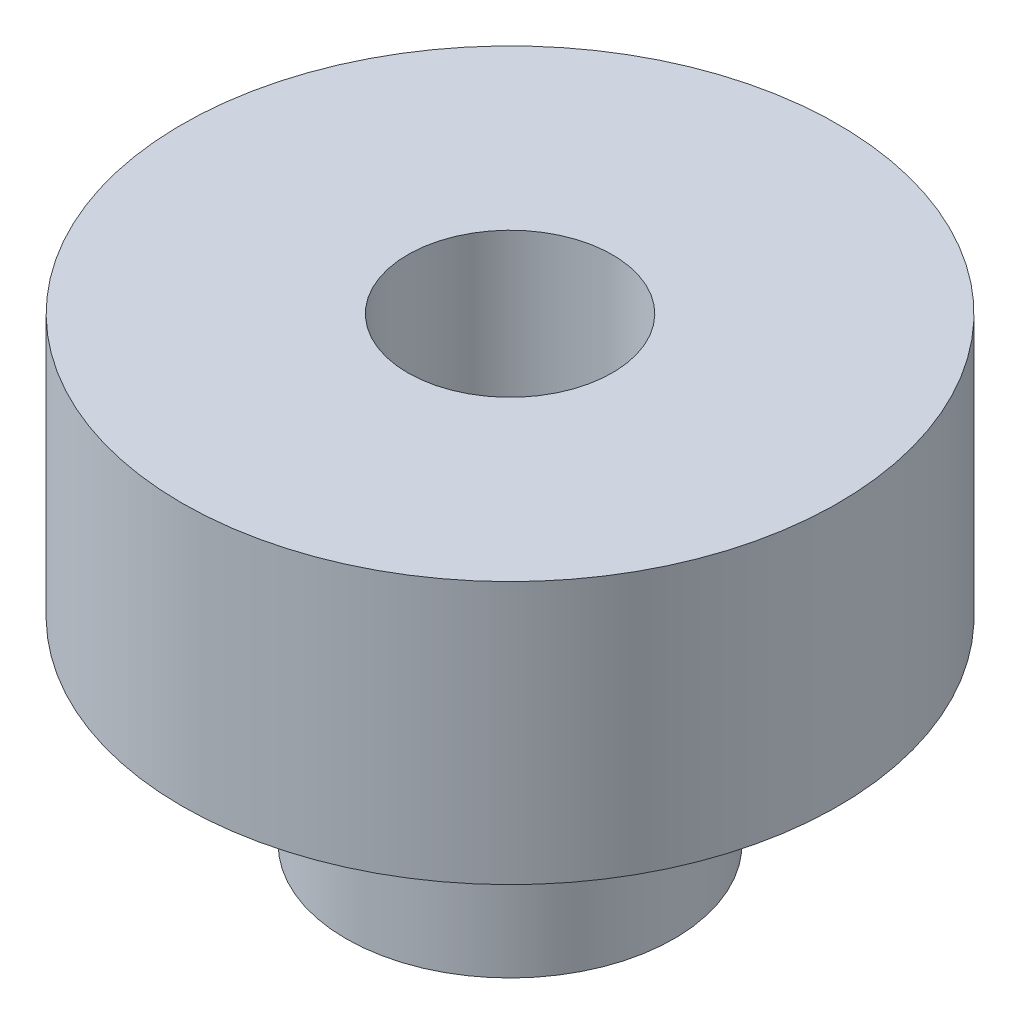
ISO-10303-21;
HEADER;
FILE_DESCRIPTION(('STEP AP214'),'2;1');
FILE_NAME('part.step','',(''),(''),'','','');
FILE_SCHEMA(('AUTOMOTIVE_DESIGN { 1 0 10303 214 1 1 1 1 }'));
ENDSEC;
DATA;
#1=APPLICATION_CONTEXT('core data for automotive mechanical design processes');
#2=APPLICATION_PROTOCOL_DEFINITION('international standard','automotive_design',2000,#1);
#3=PRODUCT_CONTEXT('',#1,'mechanical');
#4=PRODUCT('Part','Part','',(#3));
#5=PRODUCT_RELATED_PRODUCT_CATEGORY('part','',(#4));
#6=PRODUCT_DEFINITION_FORMATION('','',#4);
#7=PRODUCT_DEFINITION_CONTEXT('part definition',#1,'design');
#8=PRODUCT_DEFINITION('design','',#6,#7);
#9=PRODUCT_DEFINITION_SHAPE('','',#8);
#10=(LENGTH_UNIT() NAMED_UNIT(*) SI_UNIT(.MILLI.,.METRE.));
#11=(NAMED_UNIT(*) PLANE_ANGLE_UNIT() SI_UNIT($,.RADIAN.));
#12=(NAMED_UNIT(*) SI_UNIT($,.STERADIAN.) SOLID_ANGLE_UNIT());
#13=UNCERTAINTY_MEASURE_WITH_UNIT(LENGTH_MEASURE(1.E-05),#10,'distance_accuracy_value','');
#14=(GEOMETRIC_REPRESENTATION_CONTEXT(3) GLOBAL_UNCERTAINTY_ASSIGNED_CONTEXT((#13)) GLOBAL_UNIT_ASSIGNED_CONTEXT((#10,
#11,#12)) REPRESENTATION_CONTEXT('',''));
#15=CARTESIAN_POINT('',(0.,0.,0.));
#16=DIRECTION('',(0.,0.,1.));
#17=DIRECTION('',(1.,0.,0.));
#18=AXIS2_PLACEMENT_3D('',#15,#16,#17);
#19=CARTESIAN_POINT('',(3.17499999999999,-8.89,0.));
#20=DIRECTION('',(0.,-1.,0.));
#21=DIRECTION('',(0.,0.,-1.));
#22=AXIS2_PLACEMENT_3D('',#19,#20,#21);
#23=PLANE('',#22);
#24=CARTESIAN_POINT('',(0.,-8.89,0.));
#25=DIRECTION('',(0.,1.,0.));
#26=DIRECTION('',(0.,0.,1.));
#27=AXIS2_PLACEMENT_3D('',#24,#25,#26);
#28=CIRCLE('',#27,1.9812);
#29=CARTESIAN_POINT('',(0.,-8.89000000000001,1.98120000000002));
#30=VERTEX_POINT('',#29);
#31=EDGE_CURVE('E56',#30,#30,#28,.T.);
#32=ORIENTED_EDGE('',*,*,#31,.T.);
#33=EDGE_LOOP('',(#32));
#34=FACE_BOUND('',#33,.T.);
#35=CARTESIAN_POINT('',(0.,-8.89,0.));
#36=DIRECTION('',(0.,1.,0.));
#37=DIRECTION('',(0.,0.,1.));
#38=AXIS2_PLACEMENT_3D('',#35,#36,#37);
#39=CIRCLE('',#38,3.175);
#40=CARTESIAN_POINT('',(0.,-8.89000000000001,3.17500000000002));
#41=VERTEX_POINT('',#40);
#42=EDGE_CURVE('E10',#41,#41,#39,.T.);
#43=ORIENTED_EDGE('',*,*,#42,.F.);
#44=EDGE_LOOP('',(#43));
#45=FACE_BOUND('',#44,.T.);
#46=ADVANCED_FACE('F37',(#34,#45),#23,.T.);
#47=CARTESIAN_POINT('',(0.,75.5990536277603,-1.45716771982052E-13));
#48=DIRECTION('',(0.,1.,0.));
#49=DIRECTION('',(0.,0.,1.));
#50=AXIS2_PLACEMENT_3D('',#47,#48,#49);
#51=CYLINDRICAL_SURFACE('',#50,3.175);
#52=ORIENTED_EDGE('',*,*,#42,.T.);
#53=EDGE_LOOP('',(#52));
#54=FACE_BOUND('',#53,.T.);
#55=CARTESIAN_POINT('',(0.,-5.07999999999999,0.));
#56=DIRECTION('',(0.,1.,0.));
#57=DIRECTION('',(0.,0.,1.));
#58=AXIS2_PLACEMENT_3D('',#55,#56,#57);
#59=CIRCLE('',#58,3.175);
#60=CARTESIAN_POINT('',(0.,-5.08,3.17500000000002));
#61=VERTEX_POINT('',#60);
#62=EDGE_CURVE('E43',#61,#61,#59,.T.);
#63=ORIENTED_EDGE('',*,*,#62,.F.);
#64=EDGE_LOOP('',(#63));
#65=FACE_BOUND('',#64,.T.);
#66=ADVANCED_FACE('F79',(#54,#65),#51,.T.);
#67=CARTESIAN_POINT('',(6.34999999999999,-5.07999999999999,0.));
#68=DIRECTION('',(0.,-1.,0.));
#69=DIRECTION('',(0.,0.,-1.));
#70=AXIS2_PLACEMENT_3D('',#67,#68,#69);
#71=PLANE('',#70);
#72=ORIENTED_EDGE('',*,*,#62,.T.);
#73=EDGE_LOOP('',(#72));
#74=FACE_BOUND('',#73,.T.);
#75=CARTESIAN_POINT('',(0.,-5.07999999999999,0.));
#76=DIRECTION('',(0.,1.,0.));
#77=DIRECTION('',(0.,0.,1.));
#78=AXIS2_PLACEMENT_3D('',#75,#76,#77);
#79=CIRCLE('',#78,6.35);
#80=CARTESIAN_POINT('',(0.,-5.08000000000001,6.35000000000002));
#81=VERTEX_POINT('',#80);
#82=EDGE_CURVE('E47',#81,#81,#79,.T.);
#83=ORIENTED_EDGE('',*,*,#82,.F.);
#84=EDGE_LOOP('',(#83));
#85=FACE_BOUND('',#84,.T.);
#86=ADVANCED_FACE('F73',(#74,#85),#71,.T.);
#87=CARTESIAN_POINT('',(0.,75.5990536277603,-1.45716771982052E-13));
#88=DIRECTION('',(0.,1.,0.));
#89=DIRECTION('',(0.,0.,1.));
#90=AXIS2_PLACEMENT_3D('',#87,#88,#89);
#91=CYLINDRICAL_SURFACE('',#90,6.35);
#92=ORIENTED_EDGE('',*,*,#82,.T.);
#93=EDGE_LOOP('',(#92));
#94=FACE_BOUND('',#93,.T.);
#95=CARTESIAN_POINT('',(0.,0.,0.));
#96=DIRECTION('',(0.,1.,0.));
#97=DIRECTION('',(0.,0.,1.));
#98=AXIS2_PLACEMENT_3D('',#95,#96,#97);
#99=CIRCLE('',#98,6.35);
#100=CARTESIAN_POINT('',(0.,0.,6.35000000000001));
#101=VERTEX_POINT('',#100);
#102=EDGE_CURVE('E51',#101,#101,#99,.T.);
#103=ORIENTED_EDGE('',*,*,#102,.F.);
#104=EDGE_LOOP('',(#103));
#105=FACE_BOUND('',#104,.T.);
#106=ADVANCED_FACE('F68',(#94,#105),#91,.T.);
#107=CARTESIAN_POINT('',(0.,0.,0.));
#108=DIRECTION('',(0.,1.,0.));
#109=DIRECTION('',(0.,0.,1.));
#110=AXIS2_PLACEMENT_3D('',#107,#108,#109);
#111=PLANE('',#110);
#112=CARTESIAN_POINT('',(0.,0.,0.));
#113=DIRECTION('',(0.,1.,0.));
#114=DIRECTION('',(0.,0.,1.));
#115=AXIS2_PLACEMENT_3D('',#112,#113,#114);
#116=CIRCLE('',#115,1.9812);
#117=CARTESIAN_POINT('',(0.,0.,1.9812));
#118=VERTEX_POINT('',#117);
#119=EDGE_CURVE('E59',#118,#118,#116,.T.);
#120=ORIENTED_EDGE('',*,*,#119,.F.);
#121=EDGE_LOOP('',(#120));
#122=FACE_BOUND('',#121,.T.);
#123=ORIENTED_EDGE('',*,*,#102,.T.);
#124=EDGE_LOOP('',(#123));
#125=FACE_BOUND('',#124,.T.);
#126=ADVANCED_FACE('F65',(#122,#125),#111,.T.);
#127=CARTESIAN_POINT('',(0.,-8.89,0.));
#128=DIRECTION('',(0.,1.,0.));
#129=DIRECTION('',(0.,0.,1.));
#130=AXIS2_PLACEMENT_3D('',#127,#128,#129);
#131=CYLINDRICAL_SURFACE('',#130,1.9812);
#132=ORIENTED_EDGE('',*,*,#31,.F.);
#133=EDGE_LOOP('',(#132));
#134=FACE_BOUND('',#133,.T.);
#135=ORIENTED_EDGE('',*,*,#119,.T.);
#136=EDGE_LOOP('',(#135));
#137=FACE_BOUND('',#136,.T.);
#138=ADVANCED_FACE('F63',(#134,#137),#131,.F.);
#139=CLOSED_SHELL('',(#46,#66,#86,#106,#126,#138));
#140=MANIFOLD_SOLID_BREP('B2',#139);
#141=ADVANCED_BREP_SHAPE_REPRESENTATION('',(#18,#140),#14);
#142=SHAPE_DEFINITION_REPRESENTATION(#9,#141);
ENDSEC;
END-ISO-10303-21;
